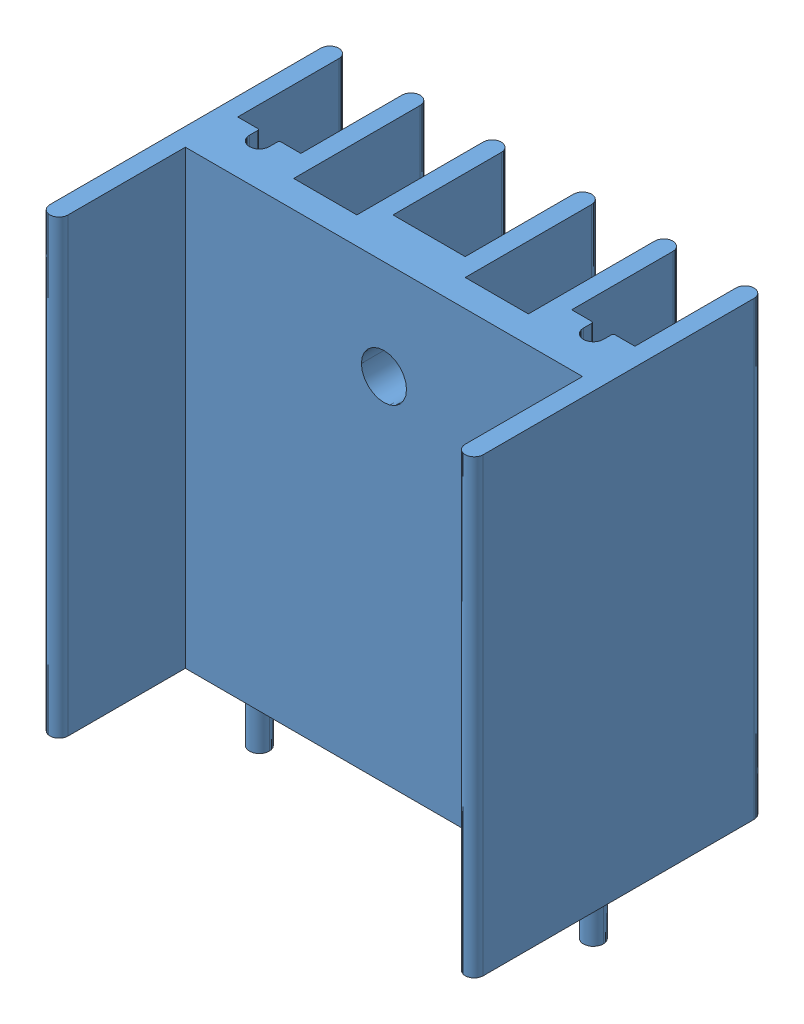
SolidWorks assembly User Library-radiator_l298.sldasm, configuration Default (file format 9000). Lengths in mm.
Overall size (24 29 16).
2 component instances, 2 part files, 0 mates.
Components (placement in the parent):
- User Library-radiator_l298_RADIATOR_L298_SOLID_1-1: User Library-radiator_l298_RADIATOR_L298_SOLID_1.sldprt [Default] at origin size (24 29 16)
- User Library-radiator_l298_RADIATOR_L298_QUILT_1-1: User Library-radiator_l298_RADIATOR_L298_QUILT_1.sldprt [Default] at origin size (3 3 2.5)
